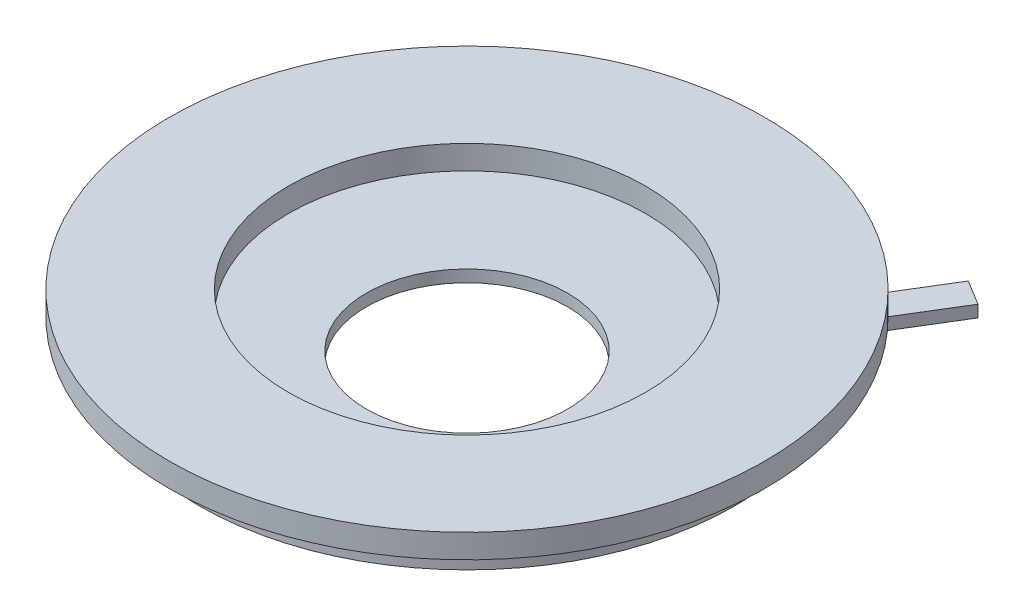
ISO-10303-21;
HEADER;
FILE_DESCRIPTION(('STEP AP214'),'2;1');
FILE_NAME('part.step','',(''),(''),'','','');
FILE_SCHEMA(('AUTOMOTIVE_DESIGN { 1 0 10303 214 1 1 1 1 }'));
ENDSEC;
DATA;
#1=APPLICATION_CONTEXT('core data for automotive mechanical design processes');
#2=APPLICATION_PROTOCOL_DEFINITION('international standard','automotive_design',2000,#1);
#3=PRODUCT_CONTEXT('',#1,'mechanical');
#4=PRODUCT('Part','Part','',(#3));
#5=PRODUCT_RELATED_PRODUCT_CATEGORY('part','',(#4));
#6=PRODUCT_DEFINITION_FORMATION('','',#4);
#7=PRODUCT_DEFINITION_CONTEXT('part definition',#1,'design');
#8=PRODUCT_DEFINITION('design','',#6,#7);
#9=PRODUCT_DEFINITION_SHAPE('','',#8);
#10=(LENGTH_UNIT() NAMED_UNIT(*) SI_UNIT(.MILLI.,.METRE.));
#11=(NAMED_UNIT(*) PLANE_ANGLE_UNIT() SI_UNIT($,.RADIAN.));
#12=(NAMED_UNIT(*) SI_UNIT($,.STERADIAN.) SOLID_ANGLE_UNIT());
#13=UNCERTAINTY_MEASURE_WITH_UNIT(LENGTH_MEASURE(1.E-05),#10,'distance_accuracy_value','');
#14=(GEOMETRIC_REPRESENTATION_CONTEXT(3) GLOBAL_UNCERTAINTY_ASSIGNED_CONTEXT((#13)) GLOBAL_UNIT_ASSIGNED_CONTEXT((#10,
#11,#12)) REPRESENTATION_CONTEXT('',''));
#15=CARTESIAN_POINT('',(0.,0.,0.));
#16=DIRECTION('',(0.,0.,1.));
#17=DIRECTION('',(1.,0.,0.));
#18=AXIS2_PLACEMENT_3D('',#15,#16,#17);
#19=CARTESIAN_POINT('',(0.,-3.5,0.));
#20=DIRECTION('',(0.,1.,0.));
#21=DIRECTION('',(0.,0.,1.));
#22=AXIS2_PLACEMENT_3D('',#19,#20,#21);
#23=PLANE('',#22);
#24=CARTESIAN_POINT('',(0.,-3.5,0.));
#25=DIRECTION('',(0.,-1.,0.));
#26=DIRECTION('',(0.,0.,1.));
#27=AXIS2_PLACEMENT_3D('',#24,#25,#26);
#28=CIRCLE('',#27,20.);
#29=CARTESIAN_POINT('',(12.430088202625,-3.5,-15.6682132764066));
#30=VERTEX_POINT('',#29);
#31=CARTESIAN_POINT('',(10.4145325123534,-3.5,-17.0744696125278));
#32=VERTEX_POINT('',#31);
#33=EDGE_CURVE('E103',#30,#32,#28,.T.);
#34=ORIENTED_EDGE('',*,*,#33,.T.);
#35=DIRECTION('',(0.520726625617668,0.,-0.85372348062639));
#36=VECTOR('',#35,1.);
#37=CARTESIAN_POINT('',(10.4145325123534,-3.5,-17.0744696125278));
#38=LINE('',#37,#36);
#39=CARTESIAN_POINT('',(15.9441925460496,-3.5,-26.14026417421));
#40=VERTEX_POINT('',#39);
#41=EDGE_CURVE('E88',#32,#40,#38,.T.);
#42=ORIENTED_EDGE('',*,*,#41,.T.);
#43=DIRECTION('',(0.853723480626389,0.,0.520726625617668));
#44=VECTOR('',#43,1.);
#45=CARTESIAN_POINT('',(15.9441925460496,-3.5,-26.14026417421));
#46=LINE('',#45,#44);
#47=CARTESIAN_POINT('',(18.0383782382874,-3.5,-24.8629205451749));
#48=VERTEX_POINT('',#47);
#49=EDGE_CURVE('E54',#40,#48,#46,.T.);
#50=ORIENTED_EDGE('',*,*,#49,.T.);
#51=DIRECTION('',(-0.520726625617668,0.,0.853723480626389));
#52=VECTOR('',#51,1.);
#53=CARTESIAN_POINT('',(18.0383782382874,-3.5,-24.8629205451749));
#54=LINE('',#53,#52);
#55=EDGE_CURVE('E49',#48,#30,#54,.T.);
#56=ORIENTED_EDGE('',*,*,#55,.T.);
#57=EDGE_LOOP('',(#34,#42,#50,#56));
#58=FACE_BOUND('',#57,.T.);
#59=CARTESIAN_POINT('',(0.,-3.5,0.));
#60=DIRECTION('',(0.,-1.,0.));
#61=DIRECTION('',(0.,0.,-1.));
#62=AXIS2_PLACEMENT_3D('',#59,#60,#61);
#63=CIRCLE('',#62,8.44444444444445);
#64=CARTESIAN_POINT('',(0.,-3.5,-8.44444444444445));
#65=VERTEX_POINT('',#64);
#66=EDGE_CURVE('E93',#65,#65,#63,.T.);
#67=ORIENTED_EDGE('',*,*,#66,.F.);
#68=EDGE_LOOP('',(#67));
#69=FACE_BOUND('',#68,.T.);
#70=ADVANCED_FACE('F34',(#58,#69),#23,.F.);
#71=CARTESIAN_POINT('',(0.,-2.5,0.));
#72=DIRECTION('',(0.,1.,0.));
#73=DIRECTION('',(0.,0.,1.));
#74=AXIS2_PLACEMENT_3D('',#71,#72,#73);
#75=PLANE('',#74);
#76=CARTESIAN_POINT('',(0.,-2.5,0.));
#77=DIRECTION('',(0.,-1.,0.));
#78=DIRECTION('',(0.,0.,1.));
#79=AXIS2_PLACEMENT_3D('',#76,#77,#78);
#80=CIRCLE('',#79,20.);
#81=CARTESIAN_POINT('',(12.430088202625,-2.5,-15.6682132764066));
#82=VERTEX_POINT('',#81);
#83=CARTESIAN_POINT('',(10.4145325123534,-2.5,-17.0744696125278));
#84=VERTEX_POINT('',#83);
#85=EDGE_CURVE('E80',#82,#84,#80,.T.);
#86=ORIENTED_EDGE('',*,*,#85,.F.);
#87=DIRECTION('',(-0.520726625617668,0.,0.853723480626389));
#88=VECTOR('',#87,1.);
#89=CARTESIAN_POINT('',(18.0383782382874,-2.5,-24.8629205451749));
#90=LINE('',#89,#88);
#91=CARTESIAN_POINT('',(18.0383782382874,-2.5,-24.8629205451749));
#92=VERTEX_POINT('',#91);
#93=EDGE_CURVE('E101',#92,#82,#90,.T.);
#94=ORIENTED_EDGE('',*,*,#93,.F.);
#95=DIRECTION('',(0.853723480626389,0.,0.520726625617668));
#96=VECTOR('',#95,1.);
#97=CARTESIAN_POINT('',(15.9441925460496,-2.5,-26.14026417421));
#98=LINE('',#97,#96);
#99=CARTESIAN_POINT('',(15.9441925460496,-2.5,-26.14026417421));
#100=VERTEX_POINT('',#99);
#101=EDGE_CURVE('E81',#100,#92,#98,.T.);
#102=ORIENTED_EDGE('',*,*,#101,.F.);
#103=DIRECTION('',(0.520726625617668,0.,-0.85372348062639));
#104=VECTOR('',#103,1.);
#105=CARTESIAN_POINT('',(10.4145325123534,-2.5,-17.0744696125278));
#106=LINE('',#105,#104);
#107=EDGE_CURVE('E75',#84,#100,#106,.T.);
#108=ORIENTED_EDGE('',*,*,#107,.F.);
#109=EDGE_LOOP('',(#86,#94,#102,#108));
#110=FACE_BOUND('',#109,.T.);
#111=CARTESIAN_POINT('',(0.,-2.5,0.));
#112=DIRECTION('',(0.,-1.,0.));
#113=DIRECTION('',(0.,0.,-1.));
#114=AXIS2_PLACEMENT_3D('',#111,#112,#113);
#115=CIRCLE('',#114,8.44444444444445);
#116=CARTESIAN_POINT('',(0.,-2.5,-8.44444444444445));
#117=VERTEX_POINT('',#116);
#118=EDGE_CURVE('E96',#117,#117,#115,.T.);
#119=ORIENTED_EDGE('',*,*,#118,.T.);
#120=EDGE_LOOP('',(#119));
#121=FACE_BOUND('',#120,.T.);
#122=ADVANCED_FACE('F76',(#110,#121),#75,.T.);
#123=CARTESIAN_POINT('',(0.,-3.5,0.));
#124=DIRECTION('',(0.,1.,0.));
#125=DIRECTION('',(0.,0.,1.));
#126=AXIS2_PLACEMENT_3D('',#123,#124,#125);
#127=CYLINDRICAL_SURFACE('',#126,20.);
#128=ORIENTED_EDGE('',*,*,#85,.T.);
#129=DIRECTION('',(0.,1.,0.));
#130=VECTOR('',#129,1.);
#131=CARTESIAN_POINT('',(10.4145325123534,-3.5,-17.0744696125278));
#132=LINE('',#131,#130);
#133=EDGE_CURVE('E12',#32,#84,#132,.T.);
#134=ORIENTED_EDGE('',*,*,#133,.F.);
#135=ORIENTED_EDGE('',*,*,#33,.F.);
#136=DIRECTION('',(0.,1.,0.));
#137=VECTOR('',#136,1.);
#138=CARTESIAN_POINT('',(12.430088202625,-3.5,-15.6682132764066));
#139=LINE('',#138,#137);
#140=EDGE_CURVE('E92',#30,#82,#139,.T.);
#141=ORIENTED_EDGE('',*,*,#140,.T.);
#142=EDGE_LOOP('',(#128,#134,#135,#141));
#143=FACE_BOUND('',#142,.T.);
#144=ADVANCED_FACE('F36',(#143),#127,.T.);
#145=CARTESIAN_POINT('',(10.4145325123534,-3.5,-17.0744696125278));
#146=DIRECTION('',(0.85372348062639,0.,0.520726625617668));
#147=DIRECTION('',(0.520726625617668,0.,-0.85372348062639));
#148=AXIS2_PLACEMENT_3D('',#145,#146,#147);
#149=PLANE('',#148);
#150=ORIENTED_EDGE('',*,*,#107,.T.);
#151=DIRECTION('',(0.,1.,0.));
#152=VECTOR('',#151,1.);
#153=CARTESIAN_POINT('',(15.9441925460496,-3.5,-26.14026417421));
#154=LINE('',#153,#152);
#155=EDGE_CURVE('E42',#40,#100,#154,.T.);
#156=ORIENTED_EDGE('',*,*,#155,.F.);
#157=ORIENTED_EDGE('',*,*,#41,.F.);
#158=ORIENTED_EDGE('',*,*,#133,.T.);
#159=EDGE_LOOP('',(#150,#156,#157,#158));
#160=FACE_BOUND('',#159,.T.);
#161=ADVANCED_FACE('F87',(#160),#149,.F.);
#162=CARTESIAN_POINT('',(15.9441925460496,-3.5,-26.14026417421));
#163=DIRECTION('',(-0.520726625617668,0.,0.853723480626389));
#164=DIRECTION('',(0.853723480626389,0.,0.520726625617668));
#165=AXIS2_PLACEMENT_3D('',#162,#163,#164);
#166=PLANE('',#165);
#167=ORIENTED_EDGE('',*,*,#101,.T.);
#168=DIRECTION('',(0.,1.,0.));
#169=VECTOR('',#168,1.);
#170=CARTESIAN_POINT('',(18.0383782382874,-3.5,-24.8629205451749));
#171=LINE('',#170,#169);
#172=EDGE_CURVE('E109',#48,#92,#171,.T.);
#173=ORIENTED_EDGE('',*,*,#172,.F.);
#174=ORIENTED_EDGE('',*,*,#49,.F.);
#175=ORIENTED_EDGE('',*,*,#155,.T.);
#176=EDGE_LOOP('',(#167,#173,#174,#175));
#177=FACE_BOUND('',#176,.T.);
#178=ADVANCED_FACE('F112',(#177),#166,.F.);
#179=CARTESIAN_POINT('',(18.0383782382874,-3.5,-24.8629205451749));
#180=DIRECTION('',(-0.853723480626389,0.,-0.520726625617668));
#181=DIRECTION('',(-0.520726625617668,0.,0.853723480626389));
#182=AXIS2_PLACEMENT_3D('',#179,#180,#181);
#183=PLANE('',#182);
#184=ORIENTED_EDGE('',*,*,#93,.T.);
#185=ORIENTED_EDGE('',*,*,#140,.F.);
#186=ORIENTED_EDGE('',*,*,#55,.F.);
#187=ORIENTED_EDGE('',*,*,#172,.T.);
#188=EDGE_LOOP('',(#184,#185,#186,#187));
#189=FACE_BOUND('',#188,.T.);
#190=ADVANCED_FACE('F114',(#189),#183,.F.);
#191=CARTESIAN_POINT('',(0.,-3.5,0.));
#192=DIRECTION('',(0.,1.,0.));
#193=DIRECTION('',(0.,0.,1.));
#194=AXIS2_PLACEMENT_3D('',#191,#192,#193);
#195=CYLINDRICAL_SURFACE('',#194,8.44444444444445);
#196=ORIENTED_EDGE('',*,*,#66,.T.);
#197=EDGE_LOOP('',(#196));
#198=FACE_BOUND('',#197,.T.);
#199=ORIENTED_EDGE('',*,*,#118,.F.);
#200=EDGE_LOOP('',(#199));
#201=FACE_BOUND('',#200,.T.);
#202=ADVANCED_FACE('F120',(#198,#201),#195,.F.);
#203=CLOSED_SHELL('',(#70,#122,#144,#161,#178,#190,#202));
#204=MANIFOLD_SOLID_BREP('B2',#203);
#205=CARTESIAN_POINT('',(0.,0.,0.));
#206=DIRECTION('',(0.,1.,0.));
#207=DIRECTION('',(0.,0.,1.));
#208=AXIS2_PLACEMENT_3D('',#205,#206,#207);
#209=PLANE('',#208);
#210=CARTESIAN_POINT('',(0.,0.,0.));
#211=DIRECTION('',(0.,1.,0.));
#212=DIRECTION('',(0.,0.,1.));
#213=AXIS2_PLACEMENT_3D('',#210,#211,#212);
#214=CIRCLE('',#213,25.);
#215=CARTESIAN_POINT('',(0.,0.,25.));
#216=VERTEX_POINT('',#215);
#217=EDGE_CURVE('E176',#216,#216,#214,.T.);
#218=ORIENTED_EDGE('',*,*,#217,.F.);
#219=EDGE_LOOP('',(#218));
#220=FACE_BOUND('',#219,.T.);
#221=CARTESIAN_POINT('',(0.,0.,0.));
#222=DIRECTION('',(0.,1.,0.));
#223=DIRECTION('',(0.,0.,1.));
#224=AXIS2_PLACEMENT_3D('',#221,#222,#223);
#225=CIRCLE('',#224,22.5);
#226=CARTESIAN_POINT('',(0.,0.,22.5));
#227=VERTEX_POINT('',#226);
#228=EDGE_CURVE('E33',#227,#227,#225,.F.);
#229=ORIENTED_EDGE('',*,*,#228,.F.);
#230=EDGE_LOOP('',(#229));
#231=FACE_BOUND('',#230,.T.);
#232=ADVANCED_FACE('F165',(#220,#231),#209,.F.);
#233=CARTESIAN_POINT('',(0.,2.,0.));
#234=DIRECTION('',(0.,1.,0.));
#235=DIRECTION('',(0.,0.,1.));
#236=AXIS2_PLACEMENT_3D('',#233,#234,#235);
#237=PLANE('',#236);
#238=CARTESIAN_POINT('',(0.,2.,0.));
#239=DIRECTION('',(0.,1.,0.));
#240=DIRECTION('',(0.,0.,1.));
#241=AXIS2_PLACEMENT_3D('',#238,#239,#240);
#242=CIRCLE('',#241,25.);
#243=CARTESIAN_POINT('',(0.,2.,25.));
#244=VERTEX_POINT('',#243);
#245=EDGE_CURVE('E172',#244,#244,#242,.T.);
#246=ORIENTED_EDGE('',*,*,#245,.T.);
#247=EDGE_LOOP('',(#246));
#248=FACE_BOUND('',#247,.T.);
#249=CARTESIAN_POINT('',(0.,2.,0.));
#250=DIRECTION('',(0.,1.,0.));
#251=DIRECTION('',(0.,0.,1.));
#252=AXIS2_PLACEMENT_3D('',#249,#250,#251);
#253=CIRCLE('',#252,15.);
#254=CARTESIAN_POINT('',(0.,2.,15.));
#255=VERTEX_POINT('',#254);
#256=EDGE_CURVE('E180',#255,#255,#253,.T.);
#257=ORIENTED_EDGE('',*,*,#256,.F.);
#258=EDGE_LOOP('',(#257));
#259=FACE_BOUND('',#258,.T.);
#260=ADVANCED_FACE('F214',(#248,#259),#237,.T.);
#261=CARTESIAN_POINT('',(0.,0.,0.));
#262=DIRECTION('',(0.,-1.,0.));
#263=DIRECTION('',(0.,0.,-1.));
#264=AXIS2_PLACEMENT_3D('',#261,#262,#263);
#265=CIRCLE('',#264,20.);
#266=CARTESIAN_POINT('',(0.,0.,-20.));
#267=VERTEX_POINT('',#266);
#268=EDGE_CURVE('E194',#267,#267,#265,.T.);
#269=ORIENTED_EDGE('',*,*,#268,.T.);
#270=EDGE_LOOP('',(#269));
#271=FACE_BOUND('',#270,.T.);
#272=CARTESIAN_POINT('',(0.,0.,0.));
#273=DIRECTION('',(0.,1.,0.));
#274=DIRECTION('',(0.,0.,1.));
#275=AXIS2_PLACEMENT_3D('',#272,#273,#274);
#276=CIRCLE('',#275,15.);
#277=CARTESIAN_POINT('',(0.,0.,15.));
#278=VERTEX_POINT('',#277);
#279=EDGE_CURVE('E185',#278,#278,#276,.T.);
#280=ORIENTED_EDGE('',*,*,#279,.T.);
#281=EDGE_LOOP('',(#280));
#282=FACE_BOUND('',#281,.T.);
#283=ADVANCED_FACE('F198',(#271,#282),#209,.F.);
#284=CARTESIAN_POINT('',(0.,2.,0.));
#285=DIRECTION('',(0.,-1.,0.));
#286=DIRECTION('',(0.,0.,-1.));
#287=AXIS2_PLACEMENT_3D('',#284,#285,#286);
#288=CYLINDRICAL_SURFACE('',#287,25.);
#289=ORIENTED_EDGE('',*,*,#245,.F.);
#290=EDGE_LOOP('',(#289));
#291=FACE_BOUND('',#290,.T.);
#292=ORIENTED_EDGE('',*,*,#217,.T.);
#293=EDGE_LOOP('',(#292));
#294=FACE_BOUND('',#293,.T.);
#295=ADVANCED_FACE('F167',(#291,#294),#288,.T.);
#296=CARTESIAN_POINT('',(0.,2.,0.));
#297=DIRECTION('',(0.,-1.,0.));
#298=DIRECTION('',(0.,0.,-1.));
#299=AXIS2_PLACEMENT_3D('',#296,#297,#298);
#300=CYLINDRICAL_SURFACE('',#299,15.);
#301=ORIENTED_EDGE('',*,*,#256,.T.);
#302=EDGE_LOOP('',(#301));
#303=FACE_BOUND('',#302,.T.);
#304=ORIENTED_EDGE('',*,*,#279,.F.);
#305=EDGE_LOOP('',(#304));
#306=FACE_BOUND('',#305,.T.);
#307=ADVANCED_FACE('F229',(#303,#306),#300,.F.);
#308=CARTESIAN_POINT('',(0.,-2.5,0.));
#309=DIRECTION('',(0.,-1.,0.));
#310=DIRECTION('',(0.,0.,-1.));
#311=AXIS2_PLACEMENT_3D('',#308,#309,#310);
#312=PLANE('',#311);
#313=CARTESIAN_POINT('',(0.,-2.5,0.));
#314=DIRECTION('',(0.,-1.,0.));
#315=DIRECTION('',(0.,0.,-1.));
#316=AXIS2_PLACEMENT_3D('',#313,#314,#315);
#317=CIRCLE('',#316,22.5);
#318=CARTESIAN_POINT('',(0.,-2.5,-22.5));
#319=VERTEX_POINT('',#318);
#320=EDGE_CURVE('E188',#319,#319,#317,.T.);
#321=ORIENTED_EDGE('',*,*,#320,.T.);
#322=EDGE_LOOP('',(#321));
#323=FACE_BOUND('',#322,.T.);
#324=CARTESIAN_POINT('',(0.,-2.5,0.));
#325=DIRECTION('',(0.,-1.,0.));
#326=DIRECTION('',(0.,0.,-1.));
#327=AXIS2_PLACEMENT_3D('',#324,#325,#326);
#328=CIRCLE('',#327,20.);
#329=CARTESIAN_POINT('',(0.,-2.5,-20.));
#330=VERTEX_POINT('',#329);
#331=EDGE_CURVE('E191',#330,#330,#328,.T.);
#332=ORIENTED_EDGE('',*,*,#331,.F.);
#333=EDGE_LOOP('',(#332));
#334=FACE_BOUND('',#333,.T.);
#335=ADVANCED_FACE('F209',(#323,#334),#312,.T.);
#336=CARTESIAN_POINT('',(0.,-2.5,0.));
#337=DIRECTION('',(0.,1.,0.));
#338=DIRECTION('',(0.,0.,1.));
#339=AXIS2_PLACEMENT_3D('',#336,#337,#338);
#340=CYLINDRICAL_SURFACE('',#339,22.5);
#341=ORIENTED_EDGE('',*,*,#320,.F.);
#342=EDGE_LOOP('',(#341));
#343=FACE_BOUND('',#342,.T.);
#344=ORIENTED_EDGE('',*,*,#228,.T.);
#345=EDGE_LOOP('',(#344));
#346=FACE_BOUND('',#345,.T.);
#347=ADVANCED_FACE('F203',(#343,#346),#340,.T.);
#348=CARTESIAN_POINT('',(0.,-2.5,0.));
#349=DIRECTION('',(0.,1.,0.));
#350=DIRECTION('',(0.,0.,1.));
#351=AXIS2_PLACEMENT_3D('',#348,#349,#350);
#352=CYLINDRICAL_SURFACE('',#351,20.);
#353=ORIENTED_EDGE('',*,*,#331,.T.);
#354=EDGE_LOOP('',(#353));
#355=FACE_BOUND('',#354,.T.);
#356=ORIENTED_EDGE('',*,*,#268,.F.);
#357=EDGE_LOOP('',(#356));
#358=FACE_BOUND('',#357,.T.);
#359=ADVANCED_FACE('F201',(#355,#358),#352,.F.);
#360=CLOSED_SHELL('',(#232,#260,#283,#295,#307,#335,#347,#359));
#361=MANIFOLD_SOLID_BREP('B6',#360);
#362=ADVANCED_BREP_SHAPE_REPRESENTATION('',(#18,#204,#361),#14);
#363=SHAPE_DEFINITION_REPRESENTATION(#9,#362);
ENDSEC;
END-ISO-10303-21;
